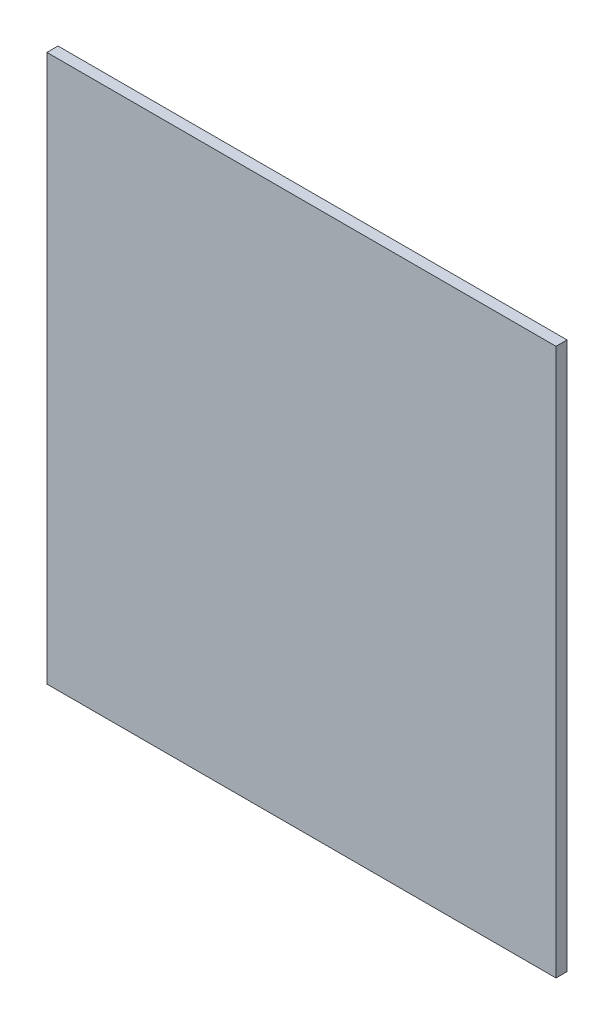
ISO-10303-21;
HEADER;
FILE_DESCRIPTION(('STEP AP214'),'2;1');
FILE_NAME('part.step','',(''),(''),'','','');
FILE_SCHEMA(('AUTOMOTIVE_DESIGN { 1 0 10303 214 1 1 1 1 }'));
ENDSEC;
DATA;
#1=APPLICATION_CONTEXT('core data for automotive mechanical design processes');
#2=APPLICATION_PROTOCOL_DEFINITION('international standard','automotive_design',2000,#1);
#3=PRODUCT_CONTEXT('',#1,'mechanical');
#4=PRODUCT('Part','Part','',(#3));
#5=PRODUCT_RELATED_PRODUCT_CATEGORY('part','',(#4));
#6=PRODUCT_DEFINITION_FORMATION('','',#4);
#7=PRODUCT_DEFINITION_CONTEXT('part definition',#1,'design');
#8=PRODUCT_DEFINITION('design','',#6,#7);
#9=PRODUCT_DEFINITION_SHAPE('','',#8);
#10=(LENGTH_UNIT() NAMED_UNIT(*) SI_UNIT(.MILLI.,.METRE.));
#11=(NAMED_UNIT(*) PLANE_ANGLE_UNIT() SI_UNIT($,.RADIAN.));
#12=(NAMED_UNIT(*) SI_UNIT($,.STERADIAN.) SOLID_ANGLE_UNIT());
#13=UNCERTAINTY_MEASURE_WITH_UNIT(LENGTH_MEASURE(1.E-05),#10,'distance_accuracy_value','');
#14=(GEOMETRIC_REPRESENTATION_CONTEXT(3) GLOBAL_UNCERTAINTY_ASSIGNED_CONTEXT((#13)) GLOBAL_UNIT_ASSIGNED_CONTEXT((#10,
#11,#12)) REPRESENTATION_CONTEXT('',''));
#15=CARTESIAN_POINT('',(0.,0.,0.));
#16=DIRECTION('',(0.,0.,1.));
#17=DIRECTION('',(1.,0.,0.));
#18=AXIS2_PLACEMENT_3D('',#15,#16,#17);
#19=CARTESIAN_POINT('',(273.224185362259,-353.209974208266,10.));
#20=DIRECTION('',(0.,1.,0.));
#21=DIRECTION('',(-1.,0.,0.));
#22=AXIS2_PLACEMENT_3D('',#19,#20,#21);
#23=PLANE('',#22);
#24=DIRECTION('',(1.,0.,0.));
#25=VECTOR('',#24,1.);
#26=CARTESIAN_POINT('',(273.224185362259,-353.209974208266,0.));
#27=LINE('',#26,#25);
#28=CARTESIAN_POINT('',(273.224185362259,-353.209974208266,0.));
#29=VERTEX_POINT('',#28);
#30=CARTESIAN_POINT('',(733.224185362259,-353.209974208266,0.));
#31=VERTEX_POINT('',#30);
#32=EDGE_CURVE('E96',#29,#31,#27,.T.);
#33=ORIENTED_EDGE('',*,*,#32,.T.);
#34=DIRECTION('',(0.,0.,-1.));
#35=VECTOR('',#34,1.);
#36=CARTESIAN_POINT('',(733.224185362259,-353.209974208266,10.));
#37=LINE('',#36,#35);
#38=CARTESIAN_POINT('',(733.224185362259,-353.209974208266,10.));
#39=VERTEX_POINT('',#38);
#40=EDGE_CURVE('E11',#39,#31,#37,.T.);
#41=ORIENTED_EDGE('',*,*,#40,.F.);
#42=DIRECTION('',(1.,0.,0.));
#43=VECTOR('',#42,1.);
#44=CARTESIAN_POINT('',(273.224185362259,-353.209974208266,10.));
#45=LINE('',#44,#43);
#46=CARTESIAN_POINT('',(273.224185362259,-353.209974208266,10.));
#47=VERTEX_POINT('',#46);
#48=EDGE_CURVE('E84',#47,#39,#45,.T.);
#49=ORIENTED_EDGE('',*,*,#48,.F.);
#50=DIRECTION('',(0.,0.,-1.));
#51=VECTOR('',#50,1.);
#52=CARTESIAN_POINT('',(273.224185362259,-353.209974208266,10.));
#53=LINE('',#52,#51);
#54=EDGE_CURVE('E92',#47,#29,#53,.T.);
#55=ORIENTED_EDGE('',*,*,#54,.T.);
#56=EDGE_LOOP('',(#33,#41,#49,#55));
#57=FACE_BOUND('',#56,.T.);
#58=ADVANCED_FACE('F33',(#57),#23,.F.);
#59=CARTESIAN_POINT('',(733.224185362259,-353.209974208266,10.));
#60=DIRECTION('',(-1.,0.,0.));
#61=DIRECTION('',(0.,0.,1.));
#62=AXIS2_PLACEMENT_3D('',#59,#60,#61);
#63=PLANE('',#62);
#64=DIRECTION('',(0.,1.,0.));
#65=VECTOR('',#64,1.);
#66=CARTESIAN_POINT('',(733.224185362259,-353.209974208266,0.));
#67=LINE('',#66,#65);
#68=CARTESIAN_POINT('',(733.224185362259,141.115905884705,0.));
#69=VERTEX_POINT('',#68);
#70=EDGE_CURVE('E88',#31,#69,#67,.T.);
#71=ORIENTED_EDGE('',*,*,#70,.T.);
#72=DIRECTION('',(0.,0.,-1.));
#73=VECTOR('',#72,1.);
#74=CARTESIAN_POINT('',(733.224185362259,141.115905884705,10.));
#75=LINE('',#74,#73);
#76=CARTESIAN_POINT('',(733.224185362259,141.115905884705,10.));
#77=VERTEX_POINT('',#76);
#78=EDGE_CURVE('E41',#77,#69,#75,.T.);
#79=ORIENTED_EDGE('',*,*,#78,.F.);
#80=DIRECTION('',(0.,1.,0.));
#81=VECTOR('',#80,1.);
#82=CARTESIAN_POINT('',(733.224185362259,-353.209974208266,10.));
#83=LINE('',#82,#81);
#84=EDGE_CURVE('E79',#39,#77,#83,.T.);
#85=ORIENTED_EDGE('',*,*,#84,.F.);
#86=ORIENTED_EDGE('',*,*,#40,.T.);
#87=EDGE_LOOP('',(#71,#79,#85,#86));
#88=FACE_BOUND('',#87,.T.);
#89=ADVANCED_FACE('F87',(#88),#63,.F.);
#90=CARTESIAN_POINT('',(273.224185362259,141.115905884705,10.));
#91=DIRECTION('',(0.,-1.,0.));
#92=DIRECTION('',(1.,0.,0.));
#93=AXIS2_PLACEMENT_3D('',#90,#91,#92);
#94=PLANE('',#93);
#95=DIRECTION('',(-1.,0.,0.));
#96=VECTOR('',#95,1.);
#97=CARTESIAN_POINT('',(273.224185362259,141.115905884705,0.));
#98=LINE('',#97,#96);
#99=CARTESIAN_POINT('',(273.224185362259,141.115905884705,0.));
#100=VERTEX_POINT('',#99);
#101=EDGE_CURVE('E66',#69,#100,#98,.T.);
#102=ORIENTED_EDGE('',*,*,#101,.T.);
#103=DIRECTION('',(0.,0.,-1.));
#104=VECTOR('',#103,1.);
#105=CARTESIAN_POINT('',(273.224185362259,141.115905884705,10.));
#106=LINE('',#105,#104);
#107=CARTESIAN_POINT('',(273.224185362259,141.115905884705,10.));
#108=VERTEX_POINT('',#107);
#109=EDGE_CURVE('E89',#108,#100,#106,.T.);
#110=ORIENTED_EDGE('',*,*,#109,.F.);
#111=DIRECTION('',(-1.,0.,0.));
#112=VECTOR('',#111,1.);
#113=CARTESIAN_POINT('',(273.224185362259,141.115905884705,10.));
#114=LINE('',#113,#112);
#115=EDGE_CURVE('E82',#77,#108,#114,.T.);
#116=ORIENTED_EDGE('',*,*,#115,.F.);
#117=ORIENTED_EDGE('',*,*,#78,.T.);
#118=EDGE_LOOP('',(#102,#110,#116,#117));
#119=FACE_BOUND('',#118,.T.);
#120=ADVANCED_FACE('F90',(#119),#94,.F.);
#121=CARTESIAN_POINT('',(273.224185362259,-353.209974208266,10.));
#122=DIRECTION('',(1.,0.,0.));
#123=DIRECTION('',(0.,0.,-1.));
#124=AXIS2_PLACEMENT_3D('',#121,#122,#123);
#125=PLANE('',#124);
#126=DIRECTION('',(0.,-1.,0.));
#127=VECTOR('',#126,1.);
#128=CARTESIAN_POINT('',(273.224185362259,-353.209974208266,0.));
#129=LINE('',#128,#127);
#130=EDGE_CURVE('E72',#100,#29,#129,.T.);
#131=ORIENTED_EDGE('',*,*,#130,.T.);
#132=ORIENTED_EDGE('',*,*,#54,.F.);
#133=DIRECTION('',(0.,-1.,0.));
#134=VECTOR('',#133,1.);
#135=CARTESIAN_POINT('',(273.224185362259,-353.209974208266,10.));
#136=LINE('',#135,#134);
#137=EDGE_CURVE('E49',#108,#47,#136,.T.);
#138=ORIENTED_EDGE('',*,*,#137,.F.);
#139=ORIENTED_EDGE('',*,*,#109,.T.);
#140=EDGE_LOOP('',(#131,#132,#138,#139));
#141=FACE_BOUND('',#140,.T.);
#142=ADVANCED_FACE('F103',(#141),#125,.F.);
#143=CARTESIAN_POINT('',(0.,0.,10.));
#144=DIRECTION('',(0.,0.,1.));
#145=DIRECTION('',(1.,0.,0.));
#146=AXIS2_PLACEMENT_3D('',#143,#144,#145);
#147=PLANE('',#146);
#148=ORIENTED_EDGE('',*,*,#48,.T.);
#149=ORIENTED_EDGE('',*,*,#84,.T.);
#150=ORIENTED_EDGE('',*,*,#115,.T.);
#151=ORIENTED_EDGE('',*,*,#137,.T.);
#152=EDGE_LOOP('',(#148,#149,#150,#151));
#153=FACE_BOUND('',#152,.T.);
#154=ADVANCED_FACE('F80',(#153),#147,.T.);
#155=CARTESIAN_POINT('',(0.,0.,0.));
#156=DIRECTION('',(0.,0.,1.));
#157=DIRECTION('',(1.,0.,0.));
#158=AXIS2_PLACEMENT_3D('',#155,#156,#157);
#159=PLANE('',#158);
#160=ORIENTED_EDGE('',*,*,#32,.F.);
#161=ORIENTED_EDGE('',*,*,#130,.F.);
#162=ORIENTED_EDGE('',*,*,#101,.F.);
#163=ORIENTED_EDGE('',*,*,#70,.F.);
#164=EDGE_LOOP('',(#160,#161,#162,#163));
#165=FACE_BOUND('',#164,.T.);
#166=ADVANCED_FACE('F106',(#165),#159,.F.);
#167=CLOSED_SHELL('',(#58,#89,#120,#142,#154,#166));
#168=MANIFOLD_SOLID_BREP('B2',#167);
#169=ADVANCED_BREP_SHAPE_REPRESENTATION('',(#18,#168),#14);
#170=SHAPE_DEFINITION_REPRESENTATION(#9,#169);
ENDSEC;
END-ISO-10303-21;
